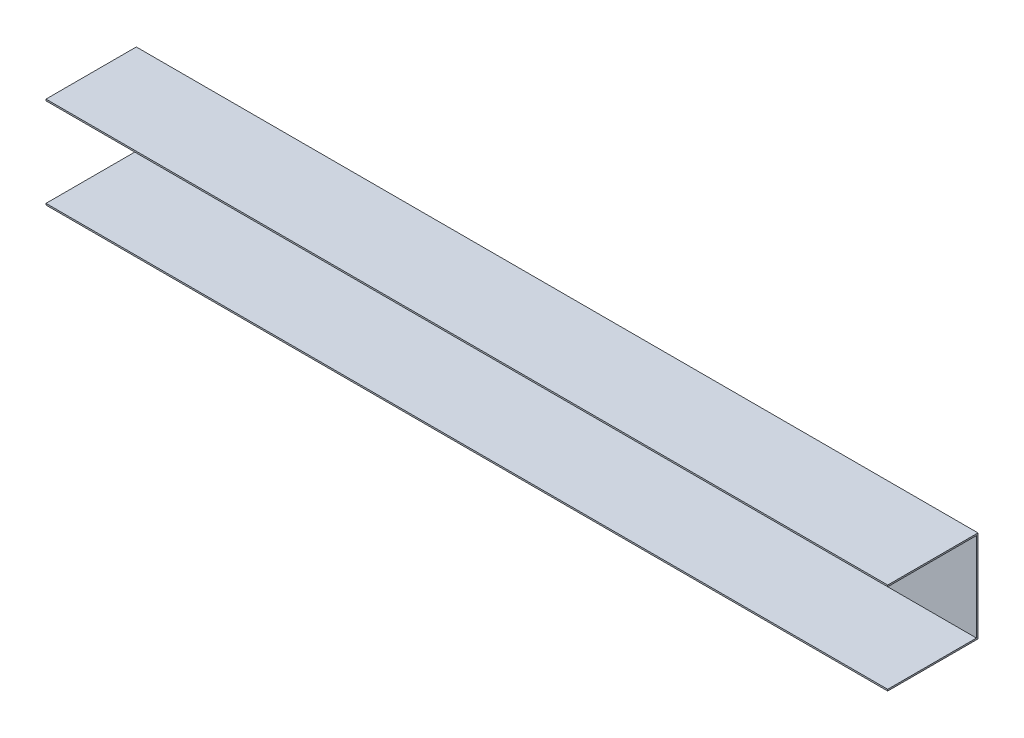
ISO-10303-21;
HEADER;
FILE_DESCRIPTION(('STEP AP214'),'2;1');
FILE_NAME('part.step','',(''),(''),'','','');
FILE_SCHEMA(('AUTOMOTIVE_DESIGN { 1 0 10303 214 1 1 1 1 }'));
ENDSEC;
DATA;
#1=APPLICATION_CONTEXT('core data for automotive mechanical design processes');
#2=APPLICATION_PROTOCOL_DEFINITION('international standard','automotive_design',2000,#1);
#3=PRODUCT_CONTEXT('',#1,'mechanical');
#4=PRODUCT('Part','Part','',(#3));
#5=PRODUCT_RELATED_PRODUCT_CATEGORY('part','',(#4));
#6=PRODUCT_DEFINITION_FORMATION('','',#4);
#7=PRODUCT_DEFINITION_CONTEXT('part definition',#1,'design');
#8=PRODUCT_DEFINITION('design','',#6,#7);
#9=PRODUCT_DEFINITION_SHAPE('','',#8);
#10=(LENGTH_UNIT() NAMED_UNIT(*) SI_UNIT(.MILLI.,.METRE.));
#11=(NAMED_UNIT(*) PLANE_ANGLE_UNIT() SI_UNIT($,.RADIAN.));
#12=(NAMED_UNIT(*) SI_UNIT($,.STERADIAN.) SOLID_ANGLE_UNIT());
#13=UNCERTAINTY_MEASURE_WITH_UNIT(LENGTH_MEASURE(1.E-05),#10,'distance_accuracy_value','');
#14=(GEOMETRIC_REPRESENTATION_CONTEXT(3) GLOBAL_UNCERTAINTY_ASSIGNED_CONTEXT((#13)) GLOBAL_UNIT_ASSIGNED_CONTEXT((#10,
#11,#12)) REPRESENTATION_CONTEXT('',''));
#15=CARTESIAN_POINT('',(0.,0.,0.));
#16=DIRECTION('',(0.,0.,1.));
#17=DIRECTION('',(1.,0.,0.));
#18=AXIS2_PLACEMENT_3D('',#15,#16,#17);
#19=CARTESIAN_POINT('',(550.,-30.,59.));
#20=DIRECTION('',(0.,1.,0.));
#21=DIRECTION('',(0.,0.,1.));
#22=AXIS2_PLACEMENT_3D('',#19,#20,#21);
#23=PLANE('',#22);
#24=DIRECTION('',(0.,0.,-1.));
#25=VECTOR('',#24,1.);
#26=CARTESIAN_POINT('',(0.,-30.,59.));
#27=LINE('',#26,#25);
#28=CARTESIAN_POINT('',(0.,-30.,59.));
#29=VERTEX_POINT('',#28);
#30=CARTESIAN_POINT('',(0.,-30.,0.));
#31=VERTEX_POINT('',#30);
#32=EDGE_CURVE('E130',#29,#31,#27,.T.);
#33=ORIENTED_EDGE('',*,*,#32,.T.);
#34=DIRECTION('',(-1.,0.,0.));
#35=VECTOR('',#34,1.);
#36=CARTESIAN_POINT('',(550.,-30.,0.));
#37=LINE('',#36,#35);
#38=CARTESIAN_POINT('',(550.,-30.,0.));
#39=VERTEX_POINT('',#38);
#40=EDGE_CURVE('E11',#39,#31,#37,.T.);
#41=ORIENTED_EDGE('',*,*,#40,.F.);
#42=DIRECTION('',(0.,0.,-1.));
#43=VECTOR('',#42,1.);
#44=CARTESIAN_POINT('',(550.,-30.,59.));
#45=LINE('',#44,#43);
#46=CARTESIAN_POINT('',(550.,-30.,59.));
#47=VERTEX_POINT('',#46);
#48=EDGE_CURVE('E144',#47,#39,#45,.T.);
#49=ORIENTED_EDGE('',*,*,#48,.F.);
#50=DIRECTION('',(-1.,0.,0.));
#51=VECTOR('',#50,1.);
#52=CARTESIAN_POINT('',(550.,-30.,59.));
#53=LINE('',#52,#51);
#54=EDGE_CURVE('E126',#47,#29,#53,.T.);
#55=ORIENTED_EDGE('',*,*,#54,.T.);
#56=EDGE_LOOP('',(#33,#41,#49,#55));
#57=FACE_BOUND('',#56,.T.);
#58=ADVANCED_FACE('F34',(#57),#23,.F.);
#59=CARTESIAN_POINT('',(550.,-30.,0.));
#60=DIRECTION('',(0.,0.,1.));
#61=DIRECTION('',(1.,0.,0.));
#62=AXIS2_PLACEMENT_3D('',#59,#60,#61);
#63=PLANE('',#62);
#64=DIRECTION('',(0.,1.,0.));
#65=VECTOR('',#64,1.);
#66=CARTESIAN_POINT('',(0.,-30.,0.));
#67=LINE('',#66,#65);
#68=CARTESIAN_POINT('',(0.,30.,0.));
#69=VERTEX_POINT('',#68);
#70=EDGE_CURVE('E133',#31,#69,#67,.T.);
#71=ORIENTED_EDGE('',*,*,#70,.T.);
#72=DIRECTION('',(-1.,0.,0.));
#73=VECTOR('',#72,1.);
#74=CARTESIAN_POINT('',(550.,30.,0.));
#75=LINE('',#74,#73);
#76=CARTESIAN_POINT('',(550.,30.,0.));
#77=VERTEX_POINT('',#76);
#78=EDGE_CURVE('E42',#77,#69,#75,.T.);
#79=ORIENTED_EDGE('',*,*,#78,.F.);
#80=DIRECTION('',(0.,1.,0.));
#81=VECTOR('',#80,1.);
#82=CARTESIAN_POINT('',(550.,-30.,0.));
#83=LINE('',#82,#81);
#84=EDGE_CURVE('E93',#39,#77,#83,.T.);
#85=ORIENTED_EDGE('',*,*,#84,.F.);
#86=ORIENTED_EDGE('',*,*,#40,.T.);
#87=EDGE_LOOP('',(#71,#79,#85,#86));
#88=FACE_BOUND('',#87,.T.);
#89=ADVANCED_FACE('F179',(#88),#63,.F.);
#90=CARTESIAN_POINT('',(550.,30.,0.));
#91=DIRECTION('',(0.,-1.,0.));
#92=DIRECTION('',(0.,0.,-1.));
#93=AXIS2_PLACEMENT_3D('',#90,#91,#92);
#94=PLANE('',#93);
#95=DIRECTION('',(0.,0.,1.));
#96=VECTOR('',#95,1.);
#97=CARTESIAN_POINT('',(0.,30.,0.));
#98=LINE('',#97,#96);
#99=CARTESIAN_POINT('',(0.,30.,59.));
#100=VERTEX_POINT('',#99);
#101=EDGE_CURVE('E135',#69,#100,#98,.T.);
#102=ORIENTED_EDGE('',*,*,#101,.T.);
#103=DIRECTION('',(-1.,0.,0.));
#104=VECTOR('',#103,1.);
#105=CARTESIAN_POINT('',(550.,30.,59.));
#106=LINE('',#105,#104);
#107=CARTESIAN_POINT('',(550.,30.,59.));
#108=VERTEX_POINT('',#107);
#109=EDGE_CURVE('E151',#108,#100,#106,.T.);
#110=ORIENTED_EDGE('',*,*,#109,.F.);
#111=DIRECTION('',(0.,0.,1.));
#112=VECTOR('',#111,1.);
#113=CARTESIAN_POINT('',(550.,30.,0.));
#114=LINE('',#113,#112);
#115=EDGE_CURVE('E159',#77,#108,#114,.T.);
#116=ORIENTED_EDGE('',*,*,#115,.F.);
#117=ORIENTED_EDGE('',*,*,#78,.T.);
#118=EDGE_LOOP('',(#102,#110,#116,#117));
#119=FACE_BOUND('',#118,.T.);
#120=ADVANCED_FACE('F157',(#119),#94,.F.);
#121=CARTESIAN_POINT('',(550.,30.,59.));
#122=DIRECTION('',(0.,0.,-1.));
#123=DIRECTION('',(-1.,0.,0.));
#124=AXIS2_PLACEMENT_3D('',#121,#122,#123);
#125=PLANE('',#124);
#126=DIRECTION('',(0.,-1.,0.));
#127=VECTOR('',#126,1.);
#128=CARTESIAN_POINT('',(0.,30.,59.));
#129=LINE('',#128,#127);
#130=CARTESIAN_POINT('',(0.,29.,59.));
#131=VERTEX_POINT('',#130);
#132=EDGE_CURVE('E137',#100,#131,#129,.T.);
#133=ORIENTED_EDGE('',*,*,#132,.T.);
#134=DIRECTION('',(-1.,0.,0.));
#135=VECTOR('',#134,1.);
#136=CARTESIAN_POINT('',(550.,29.,59.));
#137=LINE('',#136,#135);
#138=CARTESIAN_POINT('',(550.,29.,59.));
#139=VERTEX_POINT('',#138);
#140=EDGE_CURVE('E148',#139,#131,#137,.T.);
#141=ORIENTED_EDGE('',*,*,#140,.F.);
#142=DIRECTION('',(0.,-1.,0.));
#143=VECTOR('',#142,1.);
#144=CARTESIAN_POINT('',(550.,30.,59.));
#145=LINE('',#144,#143);
#146=EDGE_CURVE('E171',#108,#139,#145,.T.);
#147=ORIENTED_EDGE('',*,*,#146,.F.);
#148=ORIENTED_EDGE('',*,*,#109,.T.);
#149=EDGE_LOOP('',(#133,#141,#147,#148));
#150=FACE_BOUND('',#149,.T.);
#151=ADVANCED_FACE('F167',(#150),#125,.F.);
#152=CARTESIAN_POINT('',(550.,29.,59.));
#153=DIRECTION('',(0.,1.,0.));
#154=DIRECTION('',(0.,0.,1.));
#155=AXIS2_PLACEMENT_3D('',#152,#153,#154);
#156=PLANE('',#155);
#157=DIRECTION('',(0.,0.,-1.));
#158=VECTOR('',#157,1.);
#159=CARTESIAN_POINT('',(0.,29.,59.));
#160=LINE('',#159,#158);
#161=CARTESIAN_POINT('',(0.,29.,1.));
#162=VERTEX_POINT('',#161);
#163=EDGE_CURVE('E139',#131,#162,#160,.T.);
#164=ORIENTED_EDGE('',*,*,#163,.T.);
#165=DIRECTION('',(-1.,0.,0.));
#166=VECTOR('',#165,1.);
#167=CARTESIAN_POINT('',(550.,29.,1.));
#168=LINE('',#167,#166);
#169=CARTESIAN_POINT('',(550.,29.,1.));
#170=VERTEX_POINT('',#169);
#171=EDGE_CURVE('E121',#170,#162,#168,.T.);
#172=ORIENTED_EDGE('',*,*,#171,.F.);
#173=DIRECTION('',(0.,0.,-1.));
#174=VECTOR('',#173,1.);
#175=CARTESIAN_POINT('',(550.,29.,59.));
#176=LINE('',#175,#174);
#177=EDGE_CURVE('E112',#139,#170,#176,.T.);
#178=ORIENTED_EDGE('',*,*,#177,.F.);
#179=ORIENTED_EDGE('',*,*,#140,.T.);
#180=EDGE_LOOP('',(#164,#172,#178,#179));
#181=FACE_BOUND('',#180,.T.);
#182=ADVANCED_FACE('F170',(#181),#156,.F.);
#183=CARTESIAN_POINT('',(550.,29.,1.));
#184=DIRECTION('',(0.,0.,-1.));
#185=DIRECTION('',(-1.,0.,0.));
#186=AXIS2_PLACEMENT_3D('',#183,#184,#185);
#187=PLANE('',#186);
#188=DIRECTION('',(0.,-1.,0.));
#189=VECTOR('',#188,1.);
#190=CARTESIAN_POINT('',(0.,29.,1.));
#191=LINE('',#190,#189);
#192=CARTESIAN_POINT('',(0.,-29.,1.));
#193=VERTEX_POINT('',#192);
#194=EDGE_CURVE('E120',#162,#193,#191,.T.);
#195=ORIENTED_EDGE('',*,*,#194,.T.);
#196=DIRECTION('',(-1.,0.,0.));
#197=VECTOR('',#196,1.);
#198=CARTESIAN_POINT('',(550.,-29.,1.));
#199=LINE('',#198,#197);
#200=CARTESIAN_POINT('',(550.,-29.,1.));
#201=VERTEX_POINT('',#200);
#202=EDGE_CURVE('E117',#201,#193,#199,.T.);
#203=ORIENTED_EDGE('',*,*,#202,.F.);
#204=DIRECTION('',(0.,-1.,0.));
#205=VECTOR('',#204,1.);
#206=CARTESIAN_POINT('',(550.,29.,1.));
#207=LINE('',#206,#205);
#208=EDGE_CURVE('E106',#170,#201,#207,.T.);
#209=ORIENTED_EDGE('',*,*,#208,.F.);
#210=ORIENTED_EDGE('',*,*,#171,.T.);
#211=EDGE_LOOP('',(#195,#203,#209,#210));
#212=FACE_BOUND('',#211,.T.);
#213=ADVANCED_FACE('F118',(#212),#187,.F.);
#214=CARTESIAN_POINT('',(550.,-29.,1.));
#215=DIRECTION('',(0.,-1.,0.));
#216=DIRECTION('',(0.,0.,-1.));
#217=AXIS2_PLACEMENT_3D('',#214,#215,#216);
#218=PLANE('',#217);
#219=DIRECTION('',(0.,0.,1.));
#220=VECTOR('',#219,1.);
#221=CARTESIAN_POINT('',(0.,-29.,1.));
#222=LINE('',#221,#220);
#223=CARTESIAN_POINT('',(0.,-29.,59.));
#224=VERTEX_POINT('',#223);
#225=EDGE_CURVE('E79',#193,#224,#222,.T.);
#226=ORIENTED_EDGE('',*,*,#225,.T.);
#227=DIRECTION('',(-1.,0.,0.));
#228=VECTOR('',#227,1.);
#229=CARTESIAN_POINT('',(550.,-29.,59.));
#230=LINE('',#229,#228);
#231=CARTESIAN_POINT('',(550.,-29.,59.));
#232=VERTEX_POINT('',#231);
#233=EDGE_CURVE('E122',#232,#224,#230,.T.);
#234=ORIENTED_EDGE('',*,*,#233,.F.);
#235=DIRECTION('',(0.,0.,1.));
#236=VECTOR('',#235,1.);
#237=CARTESIAN_POINT('',(550.,-29.,1.));
#238=LINE('',#237,#236);
#239=EDGE_CURVE('E110',#201,#232,#238,.T.);
#240=ORIENTED_EDGE('',*,*,#239,.F.);
#241=ORIENTED_EDGE('',*,*,#202,.T.);
#242=EDGE_LOOP('',(#226,#234,#240,#241));
#243=FACE_BOUND('',#242,.T.);
#244=ADVANCED_FACE('F124',(#243),#218,.F.);
#245=CARTESIAN_POINT('',(550.,-29.,59.));
#246=DIRECTION('',(0.,0.,-1.));
#247=DIRECTION('',(-1.,0.,0.));
#248=AXIS2_PLACEMENT_3D('',#245,#246,#247);
#249=PLANE('',#248);
#250=DIRECTION('',(0.,-1.,0.));
#251=VECTOR('',#250,1.);
#252=CARTESIAN_POINT('',(0.,-29.,59.));
#253=LINE('',#252,#251);
#254=EDGE_CURVE('E85',#224,#29,#253,.T.);
#255=ORIENTED_EDGE('',*,*,#254,.T.);
#256=ORIENTED_EDGE('',*,*,#54,.F.);
#257=DIRECTION('',(0.,-1.,0.));
#258=VECTOR('',#257,1.);
#259=CARTESIAN_POINT('',(550.,-29.,59.));
#260=LINE('',#259,#258);
#261=EDGE_CURVE('E50',#232,#47,#260,.T.);
#262=ORIENTED_EDGE('',*,*,#261,.F.);
#263=ORIENTED_EDGE('',*,*,#233,.T.);
#264=EDGE_LOOP('',(#255,#256,#262,#263));
#265=FACE_BOUND('',#264,.T.);
#266=ADVANCED_FACE('F195',(#265),#249,.F.);
#267=CARTESIAN_POINT('',(550.,-30.,0.));
#268=DIRECTION('',(1.,0.,0.));
#269=DIRECTION('',(0.,0.,-1.));
#270=AXIS2_PLACEMENT_3D('',#267,#268,#269);
#271=PLANE('',#270);
#272=ORIENTED_EDGE('',*,*,#48,.T.);
#273=ORIENTED_EDGE('',*,*,#84,.T.);
#274=ORIENTED_EDGE('',*,*,#115,.T.);
#275=ORIENTED_EDGE('',*,*,#146,.T.);
#276=ORIENTED_EDGE('',*,*,#177,.T.);
#277=ORIENTED_EDGE('',*,*,#208,.T.);
#278=ORIENTED_EDGE('',*,*,#239,.T.);
#279=ORIENTED_EDGE('',*,*,#261,.T.);
#280=EDGE_LOOP('',(#272,#273,#274,#275,#276,#277,#278,#279));
#281=FACE_BOUND('',#280,.T.);
#282=ADVANCED_FACE('F108',(#281),#271,.T.);
#283=CARTESIAN_POINT('',(0.,-30.,0.));
#284=DIRECTION('',(1.,0.,0.));
#285=DIRECTION('',(0.,0.,-1.));
#286=AXIS2_PLACEMENT_3D('',#283,#284,#285);
#287=PLANE('',#286);
#288=ORIENTED_EDGE('',*,*,#32,.F.);
#289=ORIENTED_EDGE('',*,*,#254,.F.);
#290=ORIENTED_EDGE('',*,*,#225,.F.);
#291=ORIENTED_EDGE('',*,*,#194,.F.);
#292=ORIENTED_EDGE('',*,*,#163,.F.);
#293=ORIENTED_EDGE('',*,*,#132,.F.);
#294=ORIENTED_EDGE('',*,*,#101,.F.);
#295=ORIENTED_EDGE('',*,*,#70,.F.);
#296=EDGE_LOOP('',(#288,#289,#290,#291,#292,#293,#294,#295));
#297=FACE_BOUND('',#296,.T.);
#298=ADVANCED_FACE('F163',(#297),#287,.F.);
#299=CLOSED_SHELL('',(#58,#89,#120,#151,#182,#213,#244,#266,#282,#298));
#300=MANIFOLD_SOLID_BREP('B2',#299);
#301=ADVANCED_BREP_SHAPE_REPRESENTATION('',(#18,#300),#14);
#302=SHAPE_DEFINITION_REPRESENTATION(#9,#301);
ENDSEC;
END-ISO-10303-21;
